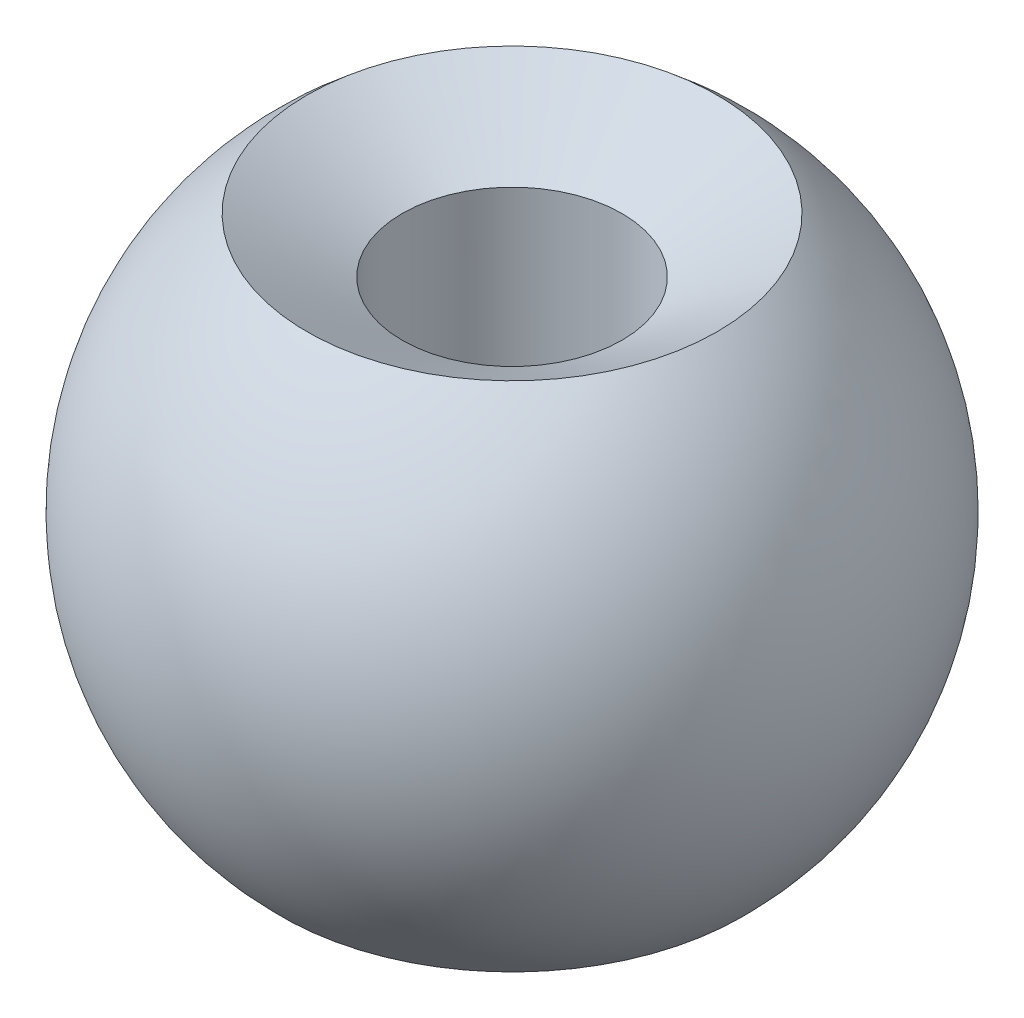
from build123d import *


with BuildPart() as part:
    # Sketch1 → Revolve1 (revolve)
    with BuildSketch(Plane.XY):
        with BuildLine():
            Line((2, 0), (2, 8))
            Line((2, 8), (3.732050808, 9))
            ThreePointArc((3.732050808, 9), (5.992498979, 4.60186354), (4.182503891, 0))
            Line((4.182503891, 0), (2, 0))
        make_face()
    revolve(axis=Axis((0, 0, 0), (0, 1, 0)))


solid = part.part
